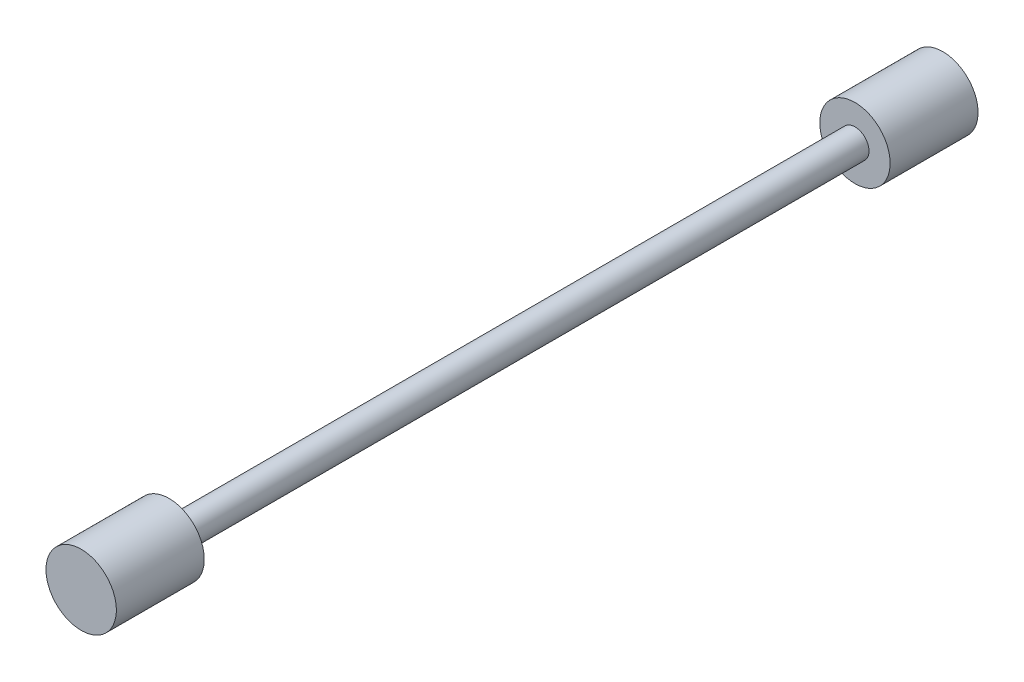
from build123d import *

# Parameters (mm, degrees)
SKETCH_1_R      = 8
SKETCH_1_R_2    = 6
EXTRUDE_1_DEPTH = 490
SKETCH_2_W      = 20
SKETCH_2_H      = 50


with BuildPart() as part:
    # Sketch 1 → Extrude 1 (new body)
    with BuildSketch(Plane.XY):
        Circle(SKETCH_1_R)
        Circle(SKETCH_1_R_2, mode=Mode.SUBTRACT)
    extrude(amount=EXTRUDE_1_DEPTH)

    # Sketch 2 → Revolve 1 (revolve)
    with BuildSketch(Plane(origin=(0, 0, 0), x_dir=(1, 0, 0), z_dir=(0, 1, 0)), mode=Mode.PRIVATE) as revolve_1_sk:
        with Locations((10, -25)):
            Rectangle(SKETCH_2_W, SKETCH_2_H)
        with Locations((10, -465)):
            Rectangle(SKETCH_2_W, SKETCH_2_H)
    revolve(revolve_1_sk.sketch.rotate(Axis((0, 0, 0), (0, 0, 1)), 180), axis=Axis((0, 0, 0), (0, 0, 1)))


solid = part.part
